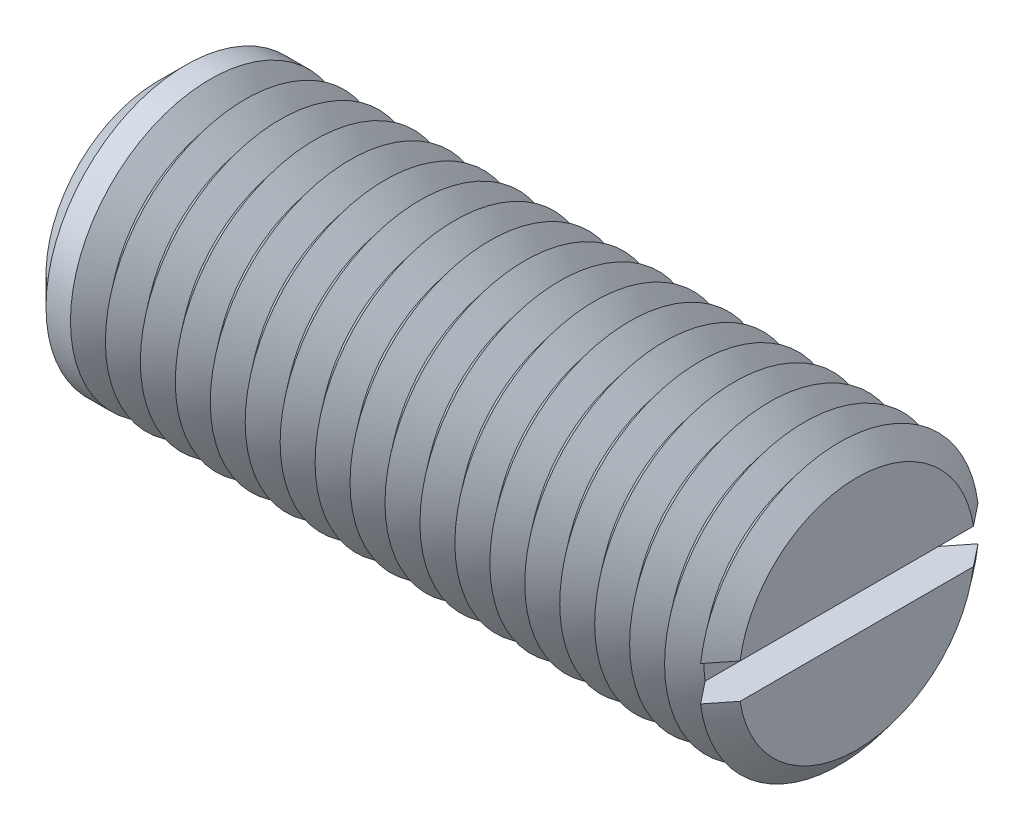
from build123d import *

# Parameters (mm, degrees)
SKETCH1_R       = 8
EXTRUDE1_DEPTH  = 20
SKETCH2_W       = 2
SKETCH2_H       = 2
EXTRUDE2_DEPTH  = 12
CHAMFER1_SIZE   = 1.6
LPATTERN1_COUNT = 19
LPATTERN1_PITCH = 2


with BuildPart() as part:
    # Sketch1 → Extrude1 (new, symmetric)
    with BuildSketch(Plane(origin=(0, 0, 0), x_dir=(0, 0, -1), z_dir=(1, 0, 0))):
        Circle(SKETCH1_R)
    extrude(amount=EXTRUDE1_DEPTH, both=True)

    # Sketch2 → Extrude2 (cut, symmetric)
    with BuildSketch(Plane.XY):
        with Locations((19, 0)):
            Rectangle(SKETCH2_W, SKETCH2_H)
    extrude(amount=EXTRUDE2_DEPTH, both=True, mode=Mode.SUBTRACT)

    # Chamfer1
    chamfer1_edges = [part.edges().sort_by_distance(p)[0] for p in [
        (-20, 0, 8),
    ]]
    chamfer(chamfer1_edges, length=CHAMFER1_SIZE)

    # Sketch3 → Cut-Revolve1 (revolve, cut)
    with BuildSketch(Plane.XY, mode=Mode.PRIVATE) as cut_revolve1_sk:
        Polygon((19, -8), (21, -8), (20, -6.7510004), align=None)
    cut_revolve1 = revolve(cut_revolve1_sk.sketch.rotate(Axis((0, 0, 0), (1, 0, 0)), 277.180755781), axis=Axis((0, 0, 0), (1, 0, 0)), mode=Mode.SUBTRACT)

    # LPattern1: Cut-Revolve1 ×19
    with Locations(*[(-i * LPATTERN1_PITCH, 0, 0) for i in range(1, LPATTERN1_COUNT)]):
        add(cut_revolve1, mode=Mode.SUBTRACT)


solid = part.part
